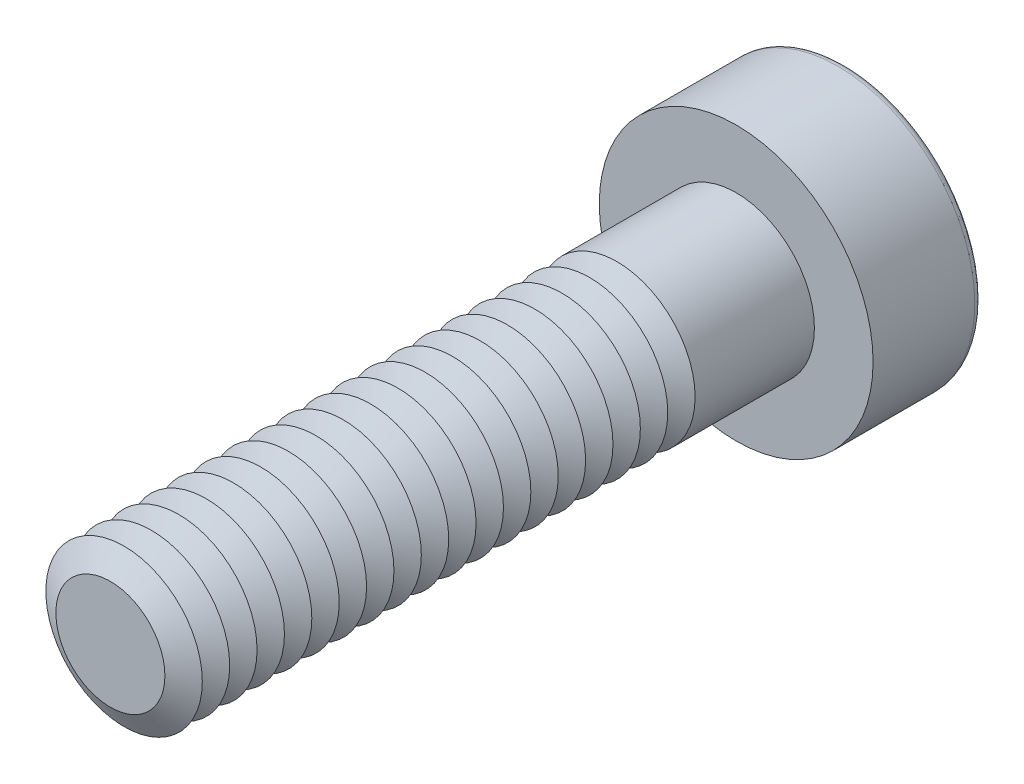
from build123d import *

# Parameters (mm, degrees)
SKETCH1_R           = 2
BOSS_EXTRUDE1_DEPTH = 16
SKETCH2_R           = 3.5
BOSS_EXTRUDE2_DEPTH = 2.8
CUT_EXTRUDE1_DEPTH  = 1.875
FILLET1_R           = 0.2
LPATTERN1_COUNT     = 19
LPATTERN1_PITCH     = 0.7


with BuildPart() as part:
    # Sketch1 → Boss-Extrude1 (new body)
    with BuildSketch(Plane.XY):
        Circle(SKETCH1_R)
    extrude(amount=BOSS_EXTRUDE1_DEPTH)

    # Sketch2 → Boss-Extrude2 (add)
    with BuildSketch(Plane(origin=(0, 0, 0), x_dir=(-1, 0, 0), z_dir=(0, 0, -1))):
        Circle(SKETCH2_R)
    extrude(amount=BOSS_EXTRUDE2_DEPTH)

    # Sketch3 → Cut-Extrude1 (cut)
    with BuildSketch(Plane(origin=(0, 0, -2.8), x_dir=(-1, 0, 0), z_dir=(0, 0, -1))):
        Polygon((-0.721687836, 1.25), (-1.443375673, 0), (-0.721687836, -1.25), (0.721687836, -1.25), (1.443375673, 0), (0.721687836, 1.25), align=None)
    extrude(amount=-CUT_EXTRUDE1_DEPTH, mode=Mode.SUBTRACT)

    # Fillet1
    fillet1_edges = [part.edges().sort_by_distance(p)[0] for p in [
        (3.5, 0, -2.8),
    ]]
    fillet(fillet1_edges, radius=FILLET1_R)

    # Cut-Extrude2 cone 1 section (on through the dimple's axis) → Cut-Extrude2 (revolve, cut)
    with BuildSketch(Plane(origin=(0, 0, -0.925), x_dir=(0, 1, 0), z_dir=(1, 0, 0))):
        Polygon((0, 0), (1.25, 0), (0, 0.721687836), align=None)
    revolve(axis=Axis((0, 0, -0.925), (0, 0, 1)), mode=Mode.SUBTRACT)

    # Cut-Extrude3 cone 1 section (on through the dimple's axis) → Cut-Extrude3 (revolve, cut)
    with BuildSketch(Plane(origin=(0, 0, -2.8), x_dir=(0, 1, 0), z_dir=(1, 0, 0))):
        Polygon((0, 0), (1.443375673, 0), (0, 0.386751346), align=None)
    revolve(axis=Axis((0, 0, -2.8), (0, 0, 1)), mode=Mode.SUBTRACT)

    # Sketch7 → Cut-Revolve1 (revolve, cut)
    with BuildSketch(Plane(origin=(0, 0, 0), x_dir=(0, 0, -1), z_dir=(1, 0, 0)), mode=Mode.PRIVATE) as cut_revolve1_sk:
        Polygon((-16, 1.393782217), (-15.65, 2), (-16.35, 2), align=None)
    cut_revolve1 = revolve(cut_revolve1_sk.sketch.rotate(Axis((0, 0, 16), (0, 0, -1)), 90), axis=Axis((0, 0, 16), (0, 0, -1)), mode=Mode.SUBTRACT)

    # LPattern1: Cut-Revolve1 ×19
    with Locations(*[(0, 0, -i * LPATTERN1_PITCH) for i in range(1, LPATTERN1_COUNT)]):
        add(cut_revolve1, mode=Mode.SUBTRACT)


solid = part.part
